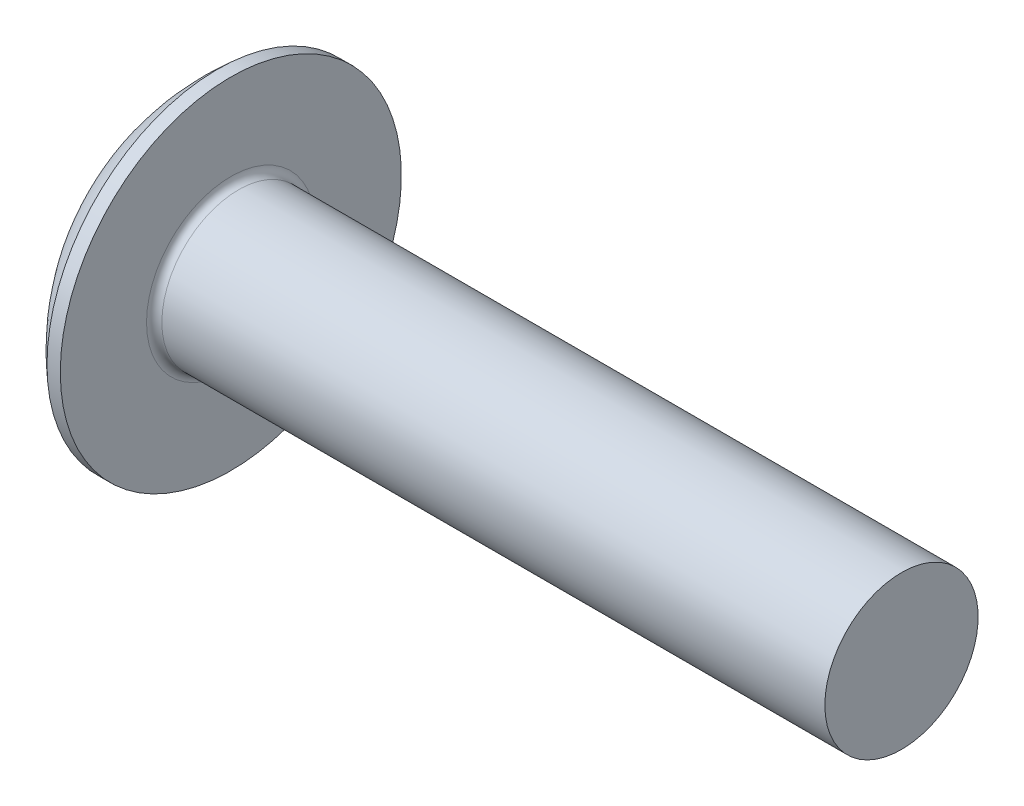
ISO-10303-21;
HEADER;
FILE_DESCRIPTION(('STEP AP214'),'2;1');
FILE_NAME('part.step','',(''),(''),'','','');
FILE_SCHEMA(('AUTOMOTIVE_DESIGN { 1 0 10303 214 1 1 1 1 }'));
ENDSEC;
DATA;
#1=APPLICATION_CONTEXT('core data for automotive mechanical design processes');
#2=APPLICATION_PROTOCOL_DEFINITION('international standard','automotive_design',2000,#1);
#3=PRODUCT_CONTEXT('',#1,'mechanical');
#4=PRODUCT('Part','Part','',(#3));
#5=PRODUCT_RELATED_PRODUCT_CATEGORY('part','',(#4));
#6=PRODUCT_DEFINITION_FORMATION('','',#4);
#7=PRODUCT_DEFINITION_CONTEXT('part definition',#1,'design');
#8=PRODUCT_DEFINITION('design','',#6,#7);
#9=PRODUCT_DEFINITION_SHAPE('','',#8);
#10=(LENGTH_UNIT() NAMED_UNIT(*) SI_UNIT(.MILLI.,.METRE.));
#11=(NAMED_UNIT(*) PLANE_ANGLE_UNIT() SI_UNIT($,.RADIAN.));
#12=(NAMED_UNIT(*) SI_UNIT($,.STERADIAN.) SOLID_ANGLE_UNIT());
#13=UNCERTAINTY_MEASURE_WITH_UNIT(LENGTH_MEASURE(1.E-05),#10,'distance_accuracy_value','');
#14=(GEOMETRIC_REPRESENTATION_CONTEXT(3) GLOBAL_UNCERTAINTY_ASSIGNED_CONTEXT((#13)) GLOBAL_UNIT_ASSIGNED_CONTEXT((#10,
#11,#12)) REPRESENTATION_CONTEXT('',''));
#15=CARTESIAN_POINT('',(0.,0.,0.));
#16=DIRECTION('',(0.,0.,1.));
#17=DIRECTION('',(1.,0.,0.));
#18=AXIS2_PLACEMENT_3D('',#15,#16,#17);
#19=CARTESIAN_POINT('',(11.7,0.,0.));
#20=DIRECTION('',(-1.,0.,0.));
#21=DIRECTION('',(0.,1.,0.));
#22=AXIS2_PLACEMENT_3D('',#19,#20,#21);
#23=SPHERICAL_SURFACE('',#22,11.7);
#24=CARTESIAN_POINT('',(4.10526498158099,0.,0.));
#25=DIRECTION('',(-1.,0.,0.));
#26=DIRECTION('',(0.,0.,1.));
#27=AXIS2_PLACEMENT_3D('',#24,#25,#26);
#28=CIRCLE('',#27,8.9);
#29=CARTESIAN_POINT('',(4.10526498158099,0.,8.9));
#30=VERTEX_POINT('',#29);
#31=EDGE_CURVE('E87',#30,#30,#28,.T.);
#32=ORIENTED_EDGE('',*,*,#31,.T.);
#33=EDGE_LOOP('',(#32));
#34=FACE_BOUND('',#33,.T.);
#35=CARTESIAN_POINT('',(11.7,-0.8,0.));
#36=DIRECTION('',(0.,1.,0.));
#37=DIRECTION('',(0.,0.,1.));
#38=AXIS2_PLACEMENT_3D('',#35,#36,#37);
#39=CIRCLE('',#38,11.6726175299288);
#40=CARTESIAN_POINT('',(2.4,-0.8,7.05407683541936));
#41=VERTEX_POINT('',#40);
#42=CARTESIAN_POINT('',(2.4,-0.8,-7.05407683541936));
#43=VERTEX_POINT('',#42);
#44=EDGE_CURVE('E45',#41,#43,#39,.F.);
#45=ORIENTED_EDGE('',*,*,#44,.T.);
#46=CARTESIAN_POINT('',(2.4,0.,0.));
#47=DIRECTION('',(-1.,0.,0.));
#48=DIRECTION('',(0.,0.,1.));
#49=AXIS2_PLACEMENT_3D('',#46,#47,#48);
#50=CIRCLE('',#49,7.09929573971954);
#51=CARTESIAN_POINT('',(2.4,0.8,-7.05407683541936));
#52=VERTEX_POINT('',#51);
#53=EDGE_CURVE('E11',#43,#52,#50,.F.);
#54=ORIENTED_EDGE('',*,*,#53,.T.);
#55=CARTESIAN_POINT('',(11.7,0.799999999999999,0.));
#56=DIRECTION('',(0.,-1.,0.));
#57=DIRECTION('',(0.,0.,-1.));
#58=AXIS2_PLACEMENT_3D('',#55,#56,#57);
#59=CIRCLE('',#58,11.6726175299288);
#60=CARTESIAN_POINT('',(2.4,0.799999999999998,7.05407683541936));
#61=VERTEX_POINT('',#60);
#62=EDGE_CURVE('E76',#52,#61,#59,.F.);
#63=ORIENTED_EDGE('',*,*,#62,.T.);
#64=EDGE_CURVE('E51',#61,#41,#50,.F.);
#65=ORIENTED_EDGE('',*,*,#64,.T.);
#66=EDGE_LOOP('',(#45,#54,#63,#65));
#67=FACE_BOUND('',#66,.T.);
#68=ADVANCED_FACE('F41',(#34,#67),#23,.T.);
#69=CARTESIAN_POINT('',(-25.4,0.,0.));
#70=DIRECTION('',(-1.,0.,0.));
#71=DIRECTION('',(0.,0.,1.));
#72=AXIS2_PLACEMENT_3D('',#69,#70,#71);
#73=CYLINDRICAL_SURFACE('',#72,4.);
#74=CARTESIAN_POINT('',(5.2,0.,0.));
#75=DIRECTION('',(-1.,0.,0.));
#76=DIRECTION('',(0.,0.,1.));
#77=AXIS2_PLACEMENT_3D('',#74,#75,#76);
#78=CIRCLE('',#77,4.);
#79=CARTESIAN_POINT('',(5.2,0.,4.));
#80=VERTEX_POINT('',#79);
#81=EDGE_CURVE('E77',#80,#80,#78,.F.);
#82=ORIENTED_EDGE('',*,*,#81,.T.);
#83=EDGE_LOOP('',(#82));
#84=FACE_BOUND('',#83,.T.);
#85=CARTESIAN_POINT('',(39.8,0.,0.));
#86=DIRECTION('',(-1.,0.,0.));
#87=DIRECTION('',(0.,0.,1.));
#88=AXIS2_PLACEMENT_3D('',#85,#86,#87);
#89=CIRCLE('',#88,4.);
#90=CARTESIAN_POINT('',(39.8,0.,4.));
#91=VERTEX_POINT('',#90);
#92=EDGE_CURVE('E84',#91,#91,#89,.T.);
#93=ORIENTED_EDGE('',*,*,#92,.T.);
#94=EDGE_LOOP('',(#93));
#95=FACE_BOUND('',#94,.T.);
#96=ADVANCED_FACE('F104',(#84,#95),#73,.T.);
#97=CARTESIAN_POINT('',(39.8,4.,0.));
#98=DIRECTION('',(1.,0.,0.));
#99=DIRECTION('',(0.,0.,-1.));
#100=AXIS2_PLACEMENT_3D('',#97,#98,#99);
#101=PLANE('',#100);
#102=ORIENTED_EDGE('',*,*,#92,.F.);
#103=EDGE_LOOP('',(#102));
#104=FACE_BOUND('',#103,.T.);
#105=ADVANCED_FACE('F111',(#104),#101,.T.);
#106=CARTESIAN_POINT('',(-25.4,0.,0.));
#107=DIRECTION('',(-1.,0.,0.));
#108=DIRECTION('',(0.,0.,1.));
#109=AXIS2_PLACEMENT_3D('',#106,#107,#108);
#110=CYLINDRICAL_SURFACE('',#109,8.9);
#111=ORIENTED_EDGE('',*,*,#31,.F.);
#112=EDGE_LOOP('',(#111));
#113=FACE_BOUND('',#112,.T.);
#114=CARTESIAN_POINT('',(4.8,0.,0.));
#115=DIRECTION('',(-1.,0.,0.));
#116=DIRECTION('',(0.,0.,1.));
#117=AXIS2_PLACEMENT_3D('',#114,#115,#116);
#118=CIRCLE('',#117,8.9);
#119=CARTESIAN_POINT('',(4.8,0.,8.9));
#120=VERTEX_POINT('',#119);
#121=EDGE_CURVE('E90',#120,#120,#118,.T.);
#122=ORIENTED_EDGE('',*,*,#121,.T.);
#123=EDGE_LOOP('',(#122));
#124=FACE_BOUND('',#123,.T.);
#125=ADVANCED_FACE('F115',(#113,#124),#110,.T.);
#126=CARTESIAN_POINT('',(4.8,4.,0.));
#127=DIRECTION('',(-1.,0.,0.));
#128=DIRECTION('',(0.,0.,1.));
#129=AXIS2_PLACEMENT_3D('',#126,#127,#128);
#130=PLANE('',#129);
#131=CARTESIAN_POINT('',(4.8,0.,0.));
#132=DIRECTION('',(-1.,0.,0.));
#133=DIRECTION('',(0.,0.,1.));
#134=AXIS2_PLACEMENT_3D('',#131,#132,#133);
#135=CIRCLE('',#134,4.4);
#136=CARTESIAN_POINT('',(4.8,0.,4.4));
#137=VERTEX_POINT('',#136);
#138=EDGE_CURVE('E81',#137,#137,#135,.T.);
#139=ORIENTED_EDGE('',*,*,#138,.T.);
#140=EDGE_LOOP('',(#139));
#141=FACE_BOUND('',#140,.T.);
#142=ORIENTED_EDGE('',*,*,#121,.F.);
#143=EDGE_LOOP('',(#142));
#144=FACE_BOUND('',#143,.T.);
#145=ADVANCED_FACE('F122',(#141,#144),#130,.F.);
#146=CARTESIAN_POINT('',(5.2,0.,0.));
#147=DIRECTION('',(-1.,0.,0.));
#148=DIRECTION('',(0.,0.,1.));
#149=AXIS2_PLACEMENT_3D('',#146,#147,#148);
#150=TOROIDAL_SURFACE('',#149,4.4,0.4);
#151=ORIENTED_EDGE('',*,*,#81,.F.);
#152=EDGE_LOOP('',(#151));
#153=FACE_BOUND('',#152,.T.);
#154=ORIENTED_EDGE('',*,*,#138,.F.);
#155=EDGE_LOOP('',(#154));
#156=FACE_BOUND('',#155,.T.);
#157=ADVANCED_FACE('F43',(#153,#156),#150,.F.);
#158=CARTESIAN_POINT('',(2.4,-0.8,8.9));
#159=DIRECTION('',(0.,1.,0.));
#160=DIRECTION('',(0.,0.,1.));
#161=AXIS2_PLACEMENT_3D('',#158,#159,#160);
#162=PLANE('',#161);
#163=DIRECTION('',(0.,0.,-1.));
#164=VECTOR('',#163,1.);
#165=CARTESIAN_POINT('',(2.4,-0.8,8.9));
#166=LINE('',#165,#164);
#167=EDGE_CURVE('E58',#41,#43,#166,.T.);
#168=ORIENTED_EDGE('',*,*,#167,.T.);
#169=ORIENTED_EDGE('',*,*,#44,.F.);
#170=EDGE_LOOP('',(#168,#169));
#171=FACE_BOUND('',#170,.T.);
#172=ADVANCED_FACE('F74',(#171),#162,.T.);
#173=CARTESIAN_POINT('',(2.4,0.8,-8.9));
#174=DIRECTION('',(0.,-1.,0.));
#175=DIRECTION('',(0.,0.,-1.));
#176=AXIS2_PLACEMENT_3D('',#173,#174,#175);
#177=PLANE('',#176);
#178=DIRECTION('',(0.,0.,1.));
#179=VECTOR('',#178,1.);
#180=CARTESIAN_POINT('',(2.4,0.8,-8.9));
#181=LINE('',#180,#179);
#182=EDGE_CURVE('E69',#52,#61,#181,.T.);
#183=ORIENTED_EDGE('',*,*,#182,.T.);
#184=ORIENTED_EDGE('',*,*,#62,.F.);
#185=EDGE_LOOP('',(#183,#184));
#186=FACE_BOUND('',#185,.T.);
#187=ADVANCED_FACE('F94',(#186),#177,.T.);
#188=CARTESIAN_POINT('',(2.4,-0.8,8.9));
#189=DIRECTION('',(-1.,0.,0.));
#190=DIRECTION('',(0.,0.,1.));
#191=AXIS2_PLACEMENT_3D('',#188,#189,#190);
#192=PLANE('',#191);
#193=ORIENTED_EDGE('',*,*,#167,.F.);
#194=ORIENTED_EDGE('',*,*,#64,.F.);
#195=ORIENTED_EDGE('',*,*,#182,.F.);
#196=ORIENTED_EDGE('',*,*,#53,.F.);
#197=EDGE_LOOP('',(#193,#194,#195,#196));
#198=FACE_BOUND('',#197,.T.);
#199=ADVANCED_FACE('F68',(#198),#192,.T.);
#200=CLOSED_SHELL('',(#68,#96,#105,#125,#145,#157,#172,#187,#199));
#201=MANIFOLD_SOLID_BREP('B2',#200);
#202=ADVANCED_BREP_SHAPE_REPRESENTATION('',(#18,#201),#14);
#203=SHAPE_DEFINITION_REPRESENTATION(#9,#202);
ENDSEC;
END-ISO-10303-21;
